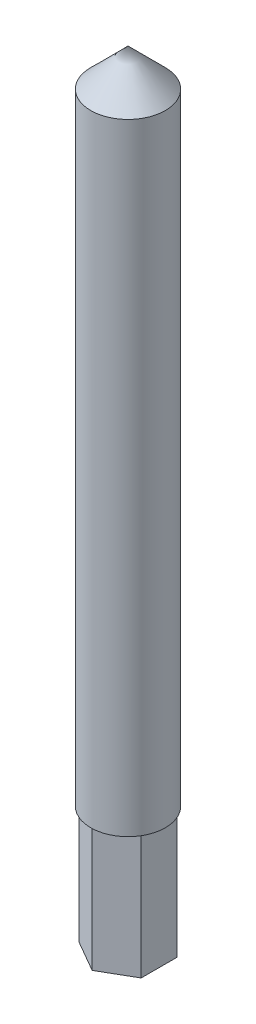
from build123d import *

# Parameters (mm, degrees)
SKETCH1_R          = 6
EXTRUDE1_DEPTH     = 120
SKETCH2_R          = 6
CUT_EXTRUDE1_DEPTH = 20


with BuildPart() as part:
    # Sketch1 → Extrude1 (new body)
    with BuildSketch(Plane(origin=(0, 0, 0), x_dir=(1, 0, 0), z_dir=(0, 1, 0))):
        with Locations(Location((0, 0, 0), (0, 0, 270))):
            Circle(SKETCH1_R)
    extrude(amount=EXTRUDE1_DEPTH)

    # Sketch2 → Cut-Extrude1 (cut)
    with BuildSketch(Plane.XZ):
        with Locations(Location((0, 0, 0), (0, 0, 270))):
            Circle(SKETCH2_R)
        Polygon((0, 5.773502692), (5, 2.886751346), (5, -2.886751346), (0, -5.773502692), (-5, -2.886751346), (-5, 2.886751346), align=None, mode=Mode.SUBTRACT)
    extrude(amount=-CUT_EXTRUDE1_DEPTH, mode=Mode.SUBTRACT)

    # Sketch3 → Revolve1 (revolve)
    with BuildSketch(Plane(origin=(0, 0, 0), x_dir=(0, 0, -1), z_dir=(1, 0, 0))):
        Polygon((6, 120), (0, 120), (0, 126), align=None)
    revolve(axis=Axis((0, 117.373416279, 0), (0, 1, 0)))


solid = part.part
